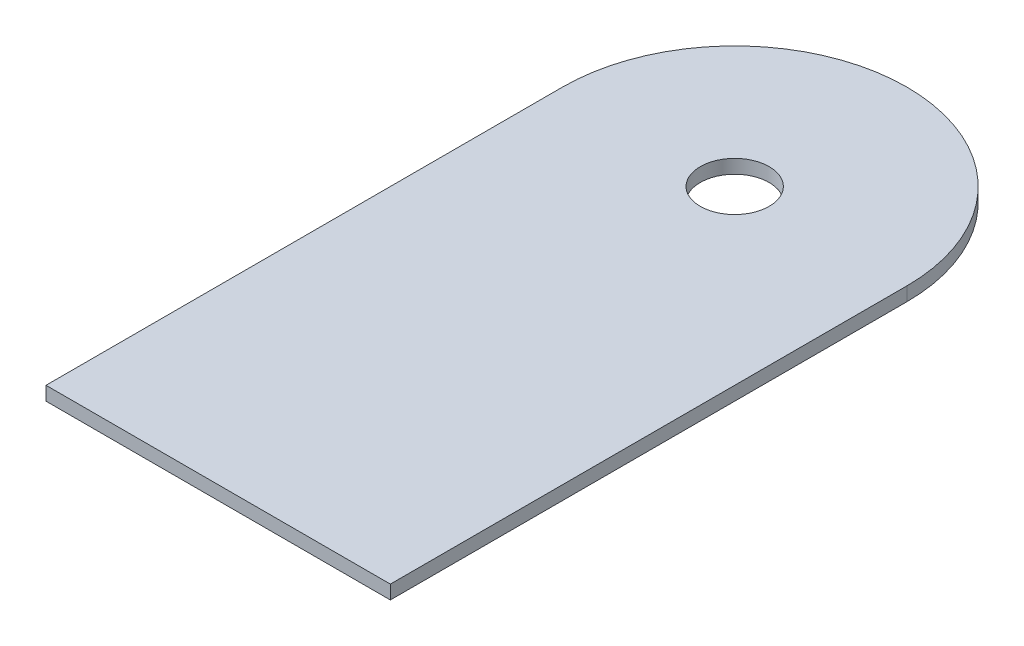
ISO-10303-21;
HEADER;
FILE_DESCRIPTION(('STEP AP214'),'2;1');
FILE_NAME('part.step','',(''),(''),'','','');
FILE_SCHEMA(('AUTOMOTIVE_DESIGN { 1 0 10303 214 1 1 1 1 }'));
ENDSEC;
DATA;
#1=APPLICATION_CONTEXT('core data for automotive mechanical design processes');
#2=APPLICATION_PROTOCOL_DEFINITION('international standard','automotive_design',2000,#1);
#3=PRODUCT_CONTEXT('',#1,'mechanical');
#4=PRODUCT('Part','Part','',(#3));
#5=PRODUCT_RELATED_PRODUCT_CATEGORY('part','',(#4));
#6=PRODUCT_DEFINITION_FORMATION('','',#4);
#7=PRODUCT_DEFINITION_CONTEXT('part definition',#1,'design');
#8=PRODUCT_DEFINITION('design','',#6,#7);
#9=PRODUCT_DEFINITION_SHAPE('','',#8);
#10=(LENGTH_UNIT() NAMED_UNIT(*) SI_UNIT(.MILLI.,.METRE.));
#11=(NAMED_UNIT(*) PLANE_ANGLE_UNIT() SI_UNIT($,.RADIAN.));
#12=(NAMED_UNIT(*) SI_UNIT($,.STERADIAN.) SOLID_ANGLE_UNIT());
#13=UNCERTAINTY_MEASURE_WITH_UNIT(LENGTH_MEASURE(1.E-05),#10,'distance_accuracy_value','');
#14=(GEOMETRIC_REPRESENTATION_CONTEXT(3) GLOBAL_UNCERTAINTY_ASSIGNED_CONTEXT((#13)) GLOBAL_UNIT_ASSIGNED_CONTEXT((#10,
#11,#12)) REPRESENTATION_CONTEXT('',''));
#15=CARTESIAN_POINT('',(0.,0.,0.));
#16=DIRECTION('',(0.,0.,1.));
#17=DIRECTION('',(1.,0.,0.));
#18=AXIS2_PLACEMENT_3D('',#15,#16,#17);
#19=CARTESIAN_POINT('',(0.,2.,0.));
#20=DIRECTION('',(0.,1.,0.));
#21=DIRECTION('',(0.,0.,1.));
#22=AXIS2_PLACEMENT_3D('',#19,#20,#21);
#23=PLANE('',#22);
#24=CARTESIAN_POINT('',(0.,2.,0.));
#25=DIRECTION('',(0.,1.,0.));
#26=DIRECTION('',(0.,0.,1.));
#27=AXIS2_PLACEMENT_3D('',#24,#25,#26);
#28=CIRCLE('',#27,25.);
#29=CARTESIAN_POINT('',(25.,2.,0.));
#30=VERTEX_POINT('',#29);
#31=CARTESIAN_POINT('',(-25.,2.,0.));
#32=VERTEX_POINT('',#31);
#33=EDGE_CURVE('E95',#30,#32,#28,.T.);
#34=ORIENTED_EDGE('',*,*,#33,.T.);
#35=DIRECTION('',(0.,0.,1.));
#36=VECTOR('',#35,1.);
#37=CARTESIAN_POINT('',(-25.,2.,75.));
#38=LINE('',#37,#36);
#39=CARTESIAN_POINT('',(-25.,2.,75.));
#40=VERTEX_POINT('',#39);
#41=EDGE_CURVE('E90',#32,#40,#38,.T.);
#42=ORIENTED_EDGE('',*,*,#41,.T.);
#43=DIRECTION('',(1.,0.,0.));
#44=VECTOR('',#43,1.);
#45=CARTESIAN_POINT('',(25.,2.,75.));
#46=LINE('',#45,#44);
#47=CARTESIAN_POINT('',(25.,2.,75.));
#48=VERTEX_POINT('',#47);
#49=EDGE_CURVE('E93',#40,#48,#46,.T.);
#50=ORIENTED_EDGE('',*,*,#49,.T.);
#51=DIRECTION('',(0.,0.,-1.));
#52=VECTOR('',#51,1.);
#53=CARTESIAN_POINT('',(25.,2.,0.));
#54=LINE('',#53,#52);
#55=EDGE_CURVE('E60',#48,#30,#54,.T.);
#56=ORIENTED_EDGE('',*,*,#55,.T.);
#57=EDGE_LOOP('',(#34,#42,#50,#56));
#58=FACE_BOUND('',#57,.T.);
#59=CARTESIAN_POINT('',(0.,2.,0.));
#60=DIRECTION('',(0.,1.,0.));
#61=DIRECTION('',(0.,0.,1.));
#62=AXIS2_PLACEMENT_3D('',#59,#60,#61);
#63=CIRCLE('',#62,5.);
#64=CARTESIAN_POINT('',(0.,2.,5.));
#65=VERTEX_POINT('',#64);
#66=EDGE_CURVE('E110',#65,#65,#63,.T.);
#67=ORIENTED_EDGE('',*,*,#66,.F.);
#68=EDGE_LOOP('',(#67));
#69=FACE_BOUND('',#68,.T.);
#70=ADVANCED_FACE('F43',(#58,#69),#23,.T.);
#71=CARTESIAN_POINT('',(0.,0.,0.));
#72=DIRECTION('',(0.,1.,0.));
#73=DIRECTION('',(0.,0.,1.));
#74=AXIS2_PLACEMENT_3D('',#71,#72,#73);
#75=PLANE('',#74);
#76=CARTESIAN_POINT('',(0.,0.,0.));
#77=DIRECTION('',(0.,1.,0.));
#78=DIRECTION('',(0.,0.,1.));
#79=AXIS2_PLACEMENT_3D('',#76,#77,#78);
#80=CIRCLE('',#79,25.);
#81=CARTESIAN_POINT('',(25.,0.,0.));
#82=VERTEX_POINT('',#81);
#83=CARTESIAN_POINT('',(-25.,0.,0.));
#84=VERTEX_POINT('',#83);
#85=EDGE_CURVE('E107',#82,#84,#80,.T.);
#86=ORIENTED_EDGE('',*,*,#85,.F.);
#87=DIRECTION('',(0.,0.,-1.));
#88=VECTOR('',#87,1.);
#89=CARTESIAN_POINT('',(25.,0.,0.));
#90=LINE('',#89,#88);
#91=CARTESIAN_POINT('',(25.,0.,75.));
#92=VERTEX_POINT('',#91);
#93=EDGE_CURVE('E83',#92,#82,#90,.T.);
#94=ORIENTED_EDGE('',*,*,#93,.F.);
#95=DIRECTION('',(1.,0.,0.));
#96=VECTOR('',#95,1.);
#97=CARTESIAN_POINT('',(25.,0.,75.));
#98=LINE('',#97,#96);
#99=CARTESIAN_POINT('',(-25.,0.,75.));
#100=VERTEX_POINT('',#99);
#101=EDGE_CURVE('E77',#100,#92,#98,.T.);
#102=ORIENTED_EDGE('',*,*,#101,.F.);
#103=DIRECTION('',(0.,0.,1.));
#104=VECTOR('',#103,1.);
#105=CARTESIAN_POINT('',(-25.,0.,75.));
#106=LINE('',#105,#104);
#107=EDGE_CURVE('E99',#84,#100,#106,.T.);
#108=ORIENTED_EDGE('',*,*,#107,.F.);
#109=EDGE_LOOP('',(#86,#94,#102,#108));
#110=FACE_BOUND('',#109,.T.);
#111=CARTESIAN_POINT('',(0.,0.,0.));
#112=DIRECTION('',(0.,1.,0.));
#113=DIRECTION('',(0.,0.,1.));
#114=AXIS2_PLACEMENT_3D('',#111,#112,#113);
#115=CIRCLE('',#114,5.);
#116=CARTESIAN_POINT('',(0.,0.,5.));
#117=VERTEX_POINT('',#116);
#118=EDGE_CURVE('E122',#117,#117,#115,.T.);
#119=ORIENTED_EDGE('',*,*,#118,.T.);
#120=EDGE_LOOP('',(#119));
#121=FACE_BOUND('',#120,.T.);
#122=ADVANCED_FACE('F118',(#110,#121),#75,.F.);
#123=CARTESIAN_POINT('',(0.,2.,0.));
#124=DIRECTION('',(0.,-1.,0.));
#125=DIRECTION('',(0.,0.,-1.));
#126=AXIS2_PLACEMENT_3D('',#123,#124,#125);
#127=CYLINDRICAL_SURFACE('',#126,25.);
#128=ORIENTED_EDGE('',*,*,#85,.T.);
#129=DIRECTION('',(0.,-1.,0.));
#130=VECTOR('',#129,1.);
#131=CARTESIAN_POINT('',(-25.,2.,0.));
#132=LINE('',#131,#130);
#133=EDGE_CURVE('E11',#32,#84,#132,.T.);
#134=ORIENTED_EDGE('',*,*,#133,.F.);
#135=ORIENTED_EDGE('',*,*,#33,.F.);
#136=DIRECTION('',(0.,-1.,0.));
#137=VECTOR('',#136,1.);
#138=CARTESIAN_POINT('',(25.,2.,0.));
#139=LINE('',#138,#137);
#140=EDGE_CURVE('E103',#30,#82,#139,.T.);
#141=ORIENTED_EDGE('',*,*,#140,.T.);
#142=EDGE_LOOP('',(#128,#134,#135,#141));
#143=FACE_BOUND('',#142,.T.);
#144=ADVANCED_FACE('F45',(#143),#127,.T.);
#145=CARTESIAN_POINT('',(-25.,2.,75.));
#146=DIRECTION('',(1.,0.,0.));
#147=DIRECTION('',(0.,0.,-1.));
#148=AXIS2_PLACEMENT_3D('',#145,#146,#147);
#149=PLANE('',#148);
#150=ORIENTED_EDGE('',*,*,#107,.T.);
#151=DIRECTION('',(0.,-1.,0.));
#152=VECTOR('',#151,1.);
#153=CARTESIAN_POINT('',(-25.,2.,75.));
#154=LINE('',#153,#152);
#155=EDGE_CURVE('E52',#40,#100,#154,.T.);
#156=ORIENTED_EDGE('',*,*,#155,.F.);
#157=ORIENTED_EDGE('',*,*,#41,.F.);
#158=ORIENTED_EDGE('',*,*,#133,.T.);
#159=EDGE_LOOP('',(#150,#156,#157,#158));
#160=FACE_BOUND('',#159,.T.);
#161=ADVANCED_FACE('F98',(#160),#149,.F.);
#162=CARTESIAN_POINT('',(25.,2.,75.));
#163=DIRECTION('',(0.,0.,-1.));
#164=DIRECTION('',(-1.,0.,0.));
#165=AXIS2_PLACEMENT_3D('',#162,#163,#164);
#166=PLANE('',#165);
#167=ORIENTED_EDGE('',*,*,#101,.T.);
#168=DIRECTION('',(0.,-1.,0.));
#169=VECTOR('',#168,1.);
#170=CARTESIAN_POINT('',(25.,2.,75.));
#171=LINE('',#170,#169);
#172=EDGE_CURVE('E100',#48,#92,#171,.T.);
#173=ORIENTED_EDGE('',*,*,#172,.F.);
#174=ORIENTED_EDGE('',*,*,#49,.F.);
#175=ORIENTED_EDGE('',*,*,#155,.T.);
#176=EDGE_LOOP('',(#167,#173,#174,#175));
#177=FACE_BOUND('',#176,.T.);
#178=ADVANCED_FACE('F101',(#177),#166,.F.);
#179=CARTESIAN_POINT('',(25.,2.,0.));
#180=DIRECTION('',(-1.,0.,0.));
#181=DIRECTION('',(0.,0.,1.));
#182=AXIS2_PLACEMENT_3D('',#179,#180,#181);
#183=PLANE('',#182);
#184=ORIENTED_EDGE('',*,*,#93,.T.);
#185=ORIENTED_EDGE('',*,*,#140,.F.);
#186=ORIENTED_EDGE('',*,*,#55,.F.);
#187=ORIENTED_EDGE('',*,*,#172,.T.);
#188=EDGE_LOOP('',(#184,#185,#186,#187));
#189=FACE_BOUND('',#188,.T.);
#190=ADVANCED_FACE('F115',(#189),#183,.F.);
#191=CARTESIAN_POINT('',(0.,2.,0.));
#192=DIRECTION('',(0.,-1.,0.));
#193=DIRECTION('',(0.,0.,-1.));
#194=AXIS2_PLACEMENT_3D('',#191,#192,#193);
#195=CYLINDRICAL_SURFACE('',#194,5.);
#196=ORIENTED_EDGE('',*,*,#66,.T.);
#197=EDGE_LOOP('',(#196));
#198=FACE_BOUND('',#197,.T.);
#199=ORIENTED_EDGE('',*,*,#118,.F.);
#200=EDGE_LOOP('',(#199));
#201=FACE_BOUND('',#200,.T.);
#202=ADVANCED_FACE('F128',(#198,#201),#195,.F.);
#203=CLOSED_SHELL('',(#70,#122,#144,#161,#178,#190,#202));
#204=MANIFOLD_SOLID_BREP('B2',#203);
#205=ADVANCED_BREP_SHAPE_REPRESENTATION('',(#18,#204),#14);
#206=SHAPE_DEFINITION_REPRESENTATION(#9,#205);
ENDSEC;
END-ISO-10303-21;
